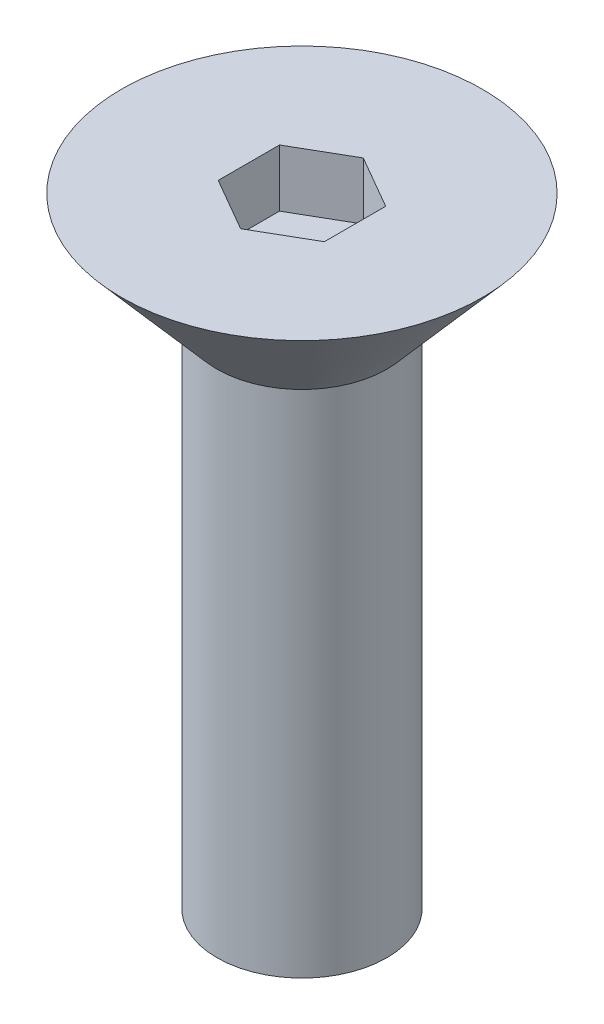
from build123d import *

# Parameters (mm, degrees)
HEXCUT_DEPTH = 2.14122


with BuildPart() as part:
    # Sketch1 → Screw (revolve)
    with BuildSketch(Plane.XY, mode=Mode.PRIVATE) as screw_sk:
        Polygon((0, 0), (6.7437, 0), (3.175, -4.105319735), (3.175, -23.155319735), (0, -23.155319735), align=None)
    revolve(screw_sk.sketch.rotate(Axis((0, 25.4, 0), (0, -1, 0)), 90), axis=Axis((0, 25.4, 0), (0, -1, 0)))

    # Sketch2 → HexCut (cut)
    with BuildSketch(Plane(origin=(0, 0, 0), x_dir=(-1, 0, 0), z_dir=(0, 1, 0))):
        Polygon((-1.984375, -1.14567944), (-1.984375, 1.14567944), (0, 2.291358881), (1.984375, 1.14567944), (1.984375, -1.14567944), (0, -2.291358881), align=None)
    extrude(amount=-HEXCUT_DEPTH, mode=Mode.SUBTRACT)


solid = part.part
